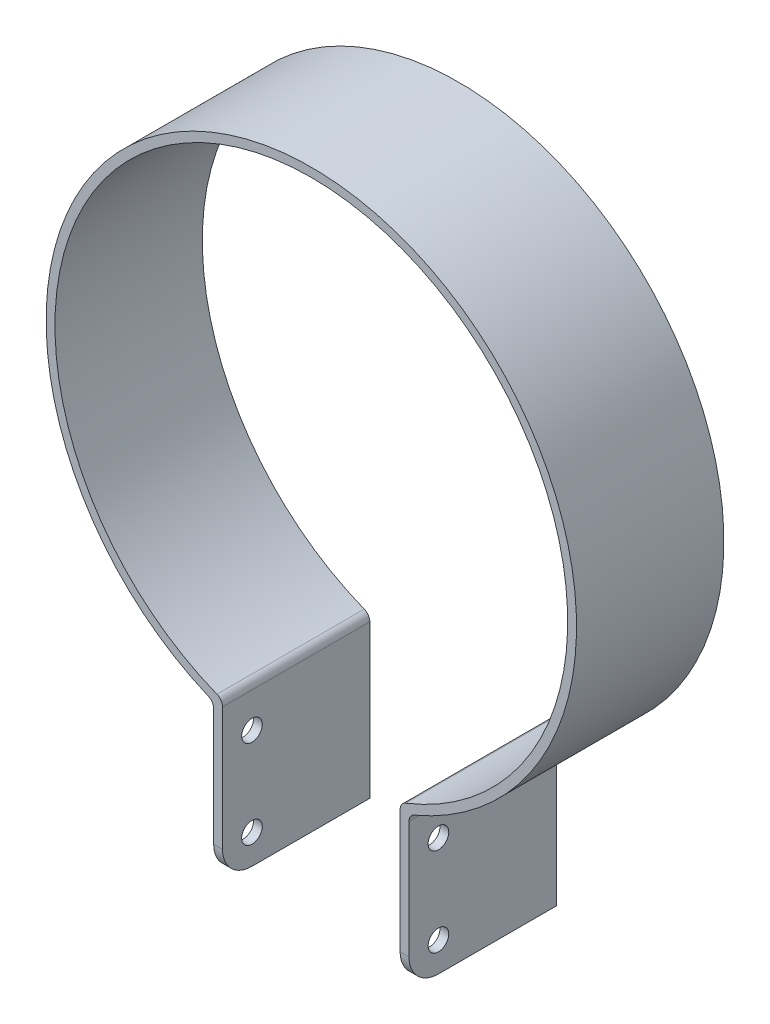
ISO-10303-21;
HEADER;
FILE_DESCRIPTION(('STEP AP214'),'2;1');
FILE_NAME('part.step','',(''),(''),'','','');
FILE_SCHEMA(('AUTOMOTIVE_DESIGN { 1 0 10303 214 1 1 1 1 }'));
ENDSEC;
DATA;
#1=APPLICATION_CONTEXT('core data for automotive mechanical design processes');
#2=APPLICATION_PROTOCOL_DEFINITION('international standard','automotive_design',2000,#1);
#3=PRODUCT_CONTEXT('',#1,'mechanical');
#4=PRODUCT('Part','Part','',(#3));
#5=PRODUCT_RELATED_PRODUCT_CATEGORY('part','',(#4));
#6=PRODUCT_DEFINITION_FORMATION('','',#4);
#7=PRODUCT_DEFINITION_CONTEXT('part definition',#1,'design');
#8=PRODUCT_DEFINITION('design','',#6,#7);
#9=PRODUCT_DEFINITION_SHAPE('','',#8);
#10=(LENGTH_UNIT() NAMED_UNIT(*) SI_UNIT(.MILLI.,.METRE.));
#11=(NAMED_UNIT(*) PLANE_ANGLE_UNIT() SI_UNIT($,.RADIAN.));
#12=(NAMED_UNIT(*) SI_UNIT($,.STERADIAN.) SOLID_ANGLE_UNIT());
#13=UNCERTAINTY_MEASURE_WITH_UNIT(LENGTH_MEASURE(1.E-05),#10,'distance_accuracy_value','');
#14=(GEOMETRIC_REPRESENTATION_CONTEXT(3) GLOBAL_UNCERTAINTY_ASSIGNED_CONTEXT((#13)) GLOBAL_UNIT_ASSIGNED_CONTEXT((#10,
#11,#12)) REPRESENTATION_CONTEXT('',''));
#15=CARTESIAN_POINT('',(0.,0.,0.));
#16=DIRECTION('',(0.,0.,1.));
#17=DIRECTION('',(1.,0.,0.));
#18=AXIS2_PLACEMENT_3D('',#15,#16,#17);
#19=CARTESIAN_POINT('',(-16.57,-67.7668095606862,25.));
#20=DIRECTION('',(0.,1.,0.));
#21=DIRECTION('',(0.,0.,1.));
#22=AXIS2_PLACEMENT_3D('',#19,#20,#21);
#23=PLANE('',#22);
#24=DIRECTION('',(0.,0.,-1.));
#25=VECTOR('',#24,1.);
#26=CARTESIAN_POINT('',(-15.07,-67.7668095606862,25.));
#27=LINE('',#26,#25);
#28=CARTESIAN_POINT('',(-15.07,-67.7668095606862,20.));
#29=VERTEX_POINT('',#28);
#30=CARTESIAN_POINT('',(-15.07,-67.7668095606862,0.));
#31=VERTEX_POINT('',#30);
#32=EDGE_CURVE('E150',#29,#31,#27,.T.);
#33=ORIENTED_EDGE('',*,*,#32,.F.);
#34=DIRECTION('',(1.,0.,0.));
#35=VECTOR('',#34,1.);
#36=CARTESIAN_POINT('',(-16.57,-67.7668095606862,20.));
#37=LINE('',#36,#35);
#38=CARTESIAN_POINT('',(-16.57,-67.7668095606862,20.));
#39=VERTEX_POINT('',#38);
#40=EDGE_CURVE('E40',#29,#39,#37,.F.);
#41=ORIENTED_EDGE('',*,*,#40,.T.);
#42=DIRECTION('',(0.,0.,-1.));
#43=VECTOR('',#42,1.);
#44=CARTESIAN_POINT('',(-16.57,-67.7668095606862,25.));
#45=LINE('',#44,#43);
#46=CARTESIAN_POINT('',(-16.57,-67.7668095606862,0.));
#47=VERTEX_POINT('',#46);
#48=EDGE_CURVE('E175',#39,#47,#45,.T.);
#49=ORIENTED_EDGE('',*,*,#48,.T.);
#50=DIRECTION('',(1.,0.,0.));
#51=VECTOR('',#50,1.);
#52=CARTESIAN_POINT('',(-16.57,-67.7668095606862,0.));
#53=LINE('',#52,#51);
#54=EDGE_CURVE('E176',#47,#31,#53,.T.);
#55=ORIENTED_EDGE('',*,*,#54,.T.);
#56=EDGE_LOOP('',(#33,#41,#49,#55));
#57=FACE_BOUND('',#56,.T.);
#58=ADVANCED_FACE('F31',(#57),#23,.F.);
#59=CARTESIAN_POINT('',(-15.07,-41.8382014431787,25.));
#60=DIRECTION('',(-1.,0.,0.));
#61=DIRECTION('',(0.,-1.,0.));
#62=AXIS2_PLACEMENT_3D('',#59,#60,#61);
#63=PLANE('',#62);
#64=CARTESIAN_POINT('',(-15.07,-62.7668095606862,20.));
#65=DIRECTION('',(-1.,0.,0.));
#66=DIRECTION('',(0.,-1.,0.));
#67=AXIS2_PLACEMENT_3D('',#64,#65,#66);
#68=CIRCLE('',#67,1.75);
#69=CARTESIAN_POINT('',(-15.07,-64.5168095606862,20.));
#70=VERTEX_POINT('',#69);
#71=EDGE_CURVE('E248',#70,#70,#68,.T.);
#72=ORIENTED_EDGE('',*,*,#71,.T.);
#73=EDGE_LOOP('',(#72));
#74=FACE_BOUND('',#73,.T.);
#75=CARTESIAN_POINT('',(-15.07,-47.7668095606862,20.));
#76=DIRECTION('',(-1.,0.,0.));
#77=DIRECTION('',(0.,-1.,0.));
#78=AXIS2_PLACEMENT_3D('',#75,#76,#77);
#79=CIRCLE('',#78,1.75);
#80=CARTESIAN_POINT('',(-15.07,-49.5168095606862,20.));
#81=VERTEX_POINT('',#80);
#82=EDGE_CURVE('E179',#81,#81,#79,.T.);
#83=ORIENTED_EDGE('',*,*,#82,.T.);
#84=EDGE_LOOP('',(#83));
#85=FACE_BOUND('',#84,.T.);
#86=DIRECTION('',(0.,1.,0.));
#87=VECTOR('',#86,1.);
#88=CARTESIAN_POINT('',(-15.07,-41.8382014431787,25.));
#89=LINE('',#88,#87);
#90=CARTESIAN_POINT('',(-15.07,-62.7668095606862,25.));
#91=VERTEX_POINT('',#90);
#92=CARTESIAN_POINT('',(-15.07,-41.8382014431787,25.));
#93=VERTEX_POINT('',#92);
#94=EDGE_CURVE('E131',#91,#93,#89,.T.);
#95=ORIENTED_EDGE('',*,*,#94,.F.);
#96=CARTESIAN_POINT('',(-15.07,-62.7668095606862,20.));
#97=DIRECTION('',(-1.,0.,0.));
#98=DIRECTION('',(0.,-1.,0.));
#99=AXIS2_PLACEMENT_3D('',#96,#97,#98);
#100=CIRCLE('',#99,5.);
#101=EDGE_CURVE('E55',#91,#29,#100,.F.);
#102=ORIENTED_EDGE('',*,*,#101,.T.);
#103=ORIENTED_EDGE('',*,*,#32,.T.);
#104=DIRECTION('',(0.,1.,0.));
#105=VECTOR('',#104,1.);
#106=CARTESIAN_POINT('',(-15.07,-41.8382014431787,0.));
#107=LINE('',#106,#105);
#108=CARTESIAN_POINT('',(-15.07,-41.8382014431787,0.));
#109=VERTEX_POINT('',#108);
#110=EDGE_CURVE('E147',#31,#109,#107,.T.);
#111=ORIENTED_EDGE('',*,*,#110,.T.);
#112=DIRECTION('',(0.,0.,-1.));
#113=VECTOR('',#112,1.);
#114=CARTESIAN_POINT('',(-15.07,-41.8382014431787,25.));
#115=LINE('',#114,#113);
#116=EDGE_CURVE('E144',#93,#109,#115,.T.);
#117=ORIENTED_EDGE('',*,*,#116,.F.);
#118=EDGE_LOOP('',(#95,#102,#103,#111,#117));
#119=FACE_BOUND('',#118,.T.);
#120=ADVANCED_FACE('F145',(#74,#85,#119),#63,.F.);
#121=CARTESIAN_POINT('',(-16.57,-41.8382014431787,25.));
#122=DIRECTION('',(0.,0.,-1.));
#123=DIRECTION('',(-1.,0.,0.));
#124=AXIS2_PLACEMENT_3D('',#121,#122,#123);
#125=CYLINDRICAL_SURFACE('',#124,1.5);
#126=CARTESIAN_POINT('',(-16.57,-41.8382014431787,0.));
#127=DIRECTION('',(0.,0.,1.));
#128=DIRECTION('',(1.,0.,0.));
#129=AXIS2_PLACEMENT_3D('',#126,#127,#128);
#130=CIRCLE('',#129,1.5);
#131=CARTESIAN_POINT('',(-16.0176666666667,-40.4435947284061,0.));
#132=VERTEX_POINT('',#131);
#133=EDGE_CURVE('E181',#109,#132,#130,.T.);
#134=ORIENTED_EDGE('',*,*,#133,.T.);
#135=DIRECTION('',(0.,0.,-1.));
#136=VECTOR('',#135,1.);
#137=CARTESIAN_POINT('',(-16.0176666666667,-40.4435947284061,25.));
#138=LINE('',#137,#136);
#139=CARTESIAN_POINT('',(-16.0176666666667,-40.4435947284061,25.));
#140=VERTEX_POINT('',#139);
#141=EDGE_CURVE('E151',#140,#132,#138,.T.);
#142=ORIENTED_EDGE('',*,*,#141,.F.);
#143=CARTESIAN_POINT('',(-16.57,-41.8382014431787,25.));
#144=DIRECTION('',(0.,0.,1.));
#145=DIRECTION('',(1.,0.,0.));
#146=AXIS2_PLACEMENT_3D('',#143,#144,#145);
#147=CIRCLE('',#146,1.5);
#148=EDGE_CURVE('E136',#93,#140,#147,.T.);
#149=ORIENTED_EDGE('',*,*,#148,.F.);
#150=ORIENTED_EDGE('',*,*,#116,.T.);
#151=EDGE_LOOP('',(#134,#142,#149,#150));
#152=FACE_BOUND('',#151,.T.);
#153=ADVANCED_FACE('F153',(#152),#125,.T.);
#154=CARTESIAN_POINT('',(0.,0.,25.));
#155=DIRECTION('',(0.,0.,-1.));
#156=DIRECTION('',(-1.,0.,0.));
#157=AXIS2_PLACEMENT_3D('',#154,#155,#156);
#158=CYLINDRICAL_SURFACE('',#157,43.5);
#159=CARTESIAN_POINT('',(0.,0.,0.));
#160=DIRECTION('',(0.,0.,-1.));
#161=DIRECTION('',(1.,0.,0.));
#162=AXIS2_PLACEMENT_3D('',#159,#160,#161);
#163=CIRCLE('',#162,43.5);
#164=CARTESIAN_POINT('',(16.0176666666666,-40.4435947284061,0.));
#165=VERTEX_POINT('',#164);
#166=EDGE_CURVE('E183',#132,#165,#163,.T.);
#167=ORIENTED_EDGE('',*,*,#166,.T.);
#168=DIRECTION('',(0.,0.,-1.));
#169=VECTOR('',#168,1.);
#170=CARTESIAN_POINT('',(16.0176666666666,-40.4435947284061,25.));
#171=LINE('',#170,#169);
#172=CARTESIAN_POINT('',(16.0176666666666,-40.4435947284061,25.));
#173=VERTEX_POINT('',#172);
#174=EDGE_CURVE('E223',#173,#165,#171,.T.);
#175=ORIENTED_EDGE('',*,*,#174,.F.);
#176=CARTESIAN_POINT('',(0.,0.,25.));
#177=DIRECTION('',(0.,0.,-1.));
#178=DIRECTION('',(1.,0.,0.));
#179=AXIS2_PLACEMENT_3D('',#176,#177,#178);
#180=CIRCLE('',#179,43.5);
#181=EDGE_CURVE('E156',#140,#173,#180,.T.);
#182=ORIENTED_EDGE('',*,*,#181,.F.);
#183=ORIENTED_EDGE('',*,*,#141,.T.);
#184=EDGE_LOOP('',(#167,#175,#182,#183));
#185=FACE_BOUND('',#184,.T.);
#186=ADVANCED_FACE('F336',(#185),#158,.F.);
#187=CARTESIAN_POINT('',(16.57,-41.8382014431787,25.));
#188=DIRECTION('',(0.,0.,-1.));
#189=DIRECTION('',(-1.,0.,0.));
#190=AXIS2_PLACEMENT_3D('',#187,#188,#189);
#191=CYLINDRICAL_SURFACE('',#190,1.5);
#192=CARTESIAN_POINT('',(16.57,-41.8382014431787,0.));
#193=DIRECTION('',(0.,0.,1.));
#194=DIRECTION('',(-1.,0.,0.));
#195=AXIS2_PLACEMENT_3D('',#192,#193,#194);
#196=CIRCLE('',#195,1.5);
#197=CARTESIAN_POINT('',(15.07,-41.8382014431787,0.));
#198=VERTEX_POINT('',#197);
#199=EDGE_CURVE('E185',#165,#198,#196,.T.);
#200=ORIENTED_EDGE('',*,*,#199,.T.);
#201=DIRECTION('',(0.,0.,-1.));
#202=VECTOR('',#201,1.);
#203=CARTESIAN_POINT('',(15.07,-41.8382014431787,25.));
#204=LINE('',#203,#202);
#205=CARTESIAN_POINT('',(15.07,-41.8382014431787,25.));
#206=VERTEX_POINT('',#205);
#207=EDGE_CURVE('E220',#206,#198,#204,.T.);
#208=ORIENTED_EDGE('',*,*,#207,.F.);
#209=CARTESIAN_POINT('',(16.57,-41.8382014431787,25.));
#210=DIRECTION('',(0.,0.,1.));
#211=DIRECTION('',(-1.,0.,0.));
#212=AXIS2_PLACEMENT_3D('',#209,#210,#211);
#213=CIRCLE('',#212,1.5);
#214=EDGE_CURVE('E158',#173,#206,#213,.T.);
#215=ORIENTED_EDGE('',*,*,#214,.F.);
#216=ORIENTED_EDGE('',*,*,#174,.T.);
#217=EDGE_LOOP('',(#200,#208,#215,#216));
#218=FACE_BOUND('',#217,.T.);
#219=ADVANCED_FACE('F302',(#218),#191,.T.);
#220=CARTESIAN_POINT('',(15.07,-41.8382014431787,25.));
#221=DIRECTION('',(1.,0.,0.));
#222=DIRECTION('',(0.,1.,0.));
#223=AXIS2_PLACEMENT_3D('',#220,#221,#222);
#224=PLANE('',#223);
#225=CARTESIAN_POINT('',(15.07,-62.7668095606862,20.));
#226=DIRECTION('',(1.,0.,0.));
#227=DIRECTION('',(0.,1.,0.));
#228=AXIS2_PLACEMENT_3D('',#225,#226,#227);
#229=CIRCLE('',#228,1.75);
#230=CARTESIAN_POINT('',(15.07,-61.0168095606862,20.));
#231=VERTEX_POINT('',#230);
#232=EDGE_CURVE('E253',#231,#231,#229,.T.);
#233=ORIENTED_EDGE('',*,*,#232,.T.);
#234=EDGE_LOOP('',(#233));
#235=FACE_BOUND('',#234,.T.);
#236=CARTESIAN_POINT('',(15.07,-47.7668095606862,20.));
#237=DIRECTION('',(1.,0.,0.));
#238=DIRECTION('',(0.,1.,0.));
#239=AXIS2_PLACEMENT_3D('',#236,#237,#238);
#240=CIRCLE('',#239,1.75);
#241=CARTESIAN_POINT('',(15.07,-46.0168095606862,20.));
#242=VERTEX_POINT('',#241);
#243=EDGE_CURVE('E241',#242,#242,#240,.T.);
#244=ORIENTED_EDGE('',*,*,#243,.T.);
#245=EDGE_LOOP('',(#244));
#246=FACE_BOUND('',#245,.T.);
#247=DIRECTION('',(0.,0.,-1.));
#248=VECTOR('',#247,1.);
#249=CARTESIAN_POINT('',(15.07,-67.7668095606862,25.));
#250=LINE('',#249,#248);
#251=CARTESIAN_POINT('',(15.07,-67.7668095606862,20.));
#252=VERTEX_POINT('',#251);
#253=CARTESIAN_POINT('',(15.07,-67.7668095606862,0.));
#254=VERTEX_POINT('',#253);
#255=EDGE_CURVE('E218',#252,#254,#250,.T.);
#256=ORIENTED_EDGE('',*,*,#255,.F.);
#257=CARTESIAN_POINT('',(15.07,-62.7668095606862,20.));
#258=DIRECTION('',(1.,0.,0.));
#259=DIRECTION('',(0.,1.,0.));
#260=AXIS2_PLACEMENT_3D('',#257,#258,#259);
#261=CIRCLE('',#260,5.);
#262=CARTESIAN_POINT('',(15.07,-62.7668095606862,25.));
#263=VERTEX_POINT('',#262);
#264=EDGE_CURVE('E236',#252,#263,#261,.F.);
#265=ORIENTED_EDGE('',*,*,#264,.T.);
#266=DIRECTION('',(0.,-1.,0.));
#267=VECTOR('',#266,1.);
#268=CARTESIAN_POINT('',(15.07,-41.8382014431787,25.));
#269=LINE('',#268,#267);
#270=EDGE_CURVE('E163',#206,#263,#269,.T.);
#271=ORIENTED_EDGE('',*,*,#270,.F.);
#272=ORIENTED_EDGE('',*,*,#207,.T.);
#273=DIRECTION('',(0.,-1.,0.));
#274=VECTOR('',#273,1.);
#275=CARTESIAN_POINT('',(15.07,-41.8382014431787,0.));
#276=LINE('',#275,#274);
#277=EDGE_CURVE('E187',#198,#254,#276,.T.);
#278=ORIENTED_EDGE('',*,*,#277,.T.);
#279=EDGE_LOOP('',(#256,#265,#271,#272,#278));
#280=FACE_BOUND('',#279,.T.);
#281=ADVANCED_FACE('F296',(#235,#246,#280),#224,.F.);
#282=CARTESIAN_POINT('',(15.07,-67.7668095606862,25.));
#283=DIRECTION('',(0.,1.,0.));
#284=DIRECTION('',(0.,0.,1.));
#285=AXIS2_PLACEMENT_3D('',#282,#283,#284);
#286=PLANE('',#285);
#287=DIRECTION('',(0.,0.,-1.));
#288=VECTOR('',#287,1.);
#289=CARTESIAN_POINT('',(16.57,-67.7668095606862,25.));
#290=LINE('',#289,#288);
#291=CARTESIAN_POINT('',(16.57,-67.7668095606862,20.));
#292=VERTEX_POINT('',#291);
#293=CARTESIAN_POINT('',(16.57,-67.7668095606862,0.));
#294=VERTEX_POINT('',#293);
#295=EDGE_CURVE('E216',#292,#294,#290,.T.);
#296=ORIENTED_EDGE('',*,*,#295,.F.);
#297=DIRECTION('',(1.,0.,0.));
#298=VECTOR('',#297,1.);
#299=CARTESIAN_POINT('',(15.07,-67.7668095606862,20.));
#300=LINE('',#299,#298);
#301=EDGE_CURVE('E234',#292,#252,#300,.F.);
#302=ORIENTED_EDGE('',*,*,#301,.T.);
#303=ORIENTED_EDGE('',*,*,#255,.T.);
#304=DIRECTION('',(1.,0.,0.));
#305=VECTOR('',#304,1.);
#306=CARTESIAN_POINT('',(15.07,-67.7668095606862,0.));
#307=LINE('',#306,#305);
#308=EDGE_CURVE('E190',#254,#294,#307,.T.);
#309=ORIENTED_EDGE('',*,*,#308,.T.);
#310=EDGE_LOOP('',(#296,#302,#303,#309));
#311=FACE_BOUND('',#310,.T.);
#312=ADVANCED_FACE('F312',(#311),#286,.F.);
#313=CARTESIAN_POINT('',(16.57,-42.8453626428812,25.));
#314=DIRECTION('',(-1.,0.,0.));
#315=DIRECTION('',(0.,-1.,0.));
#316=AXIS2_PLACEMENT_3D('',#313,#314,#315);
#317=PLANE('',#316);
#318=CARTESIAN_POINT('',(16.57,-62.7668095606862,20.));
#319=DIRECTION('',(1.,0.,0.));
#320=DIRECTION('',(0.,1.,0.));
#321=AXIS2_PLACEMENT_3D('',#318,#319,#320);
#322=CIRCLE('',#321,1.75);
#323=CARTESIAN_POINT('',(16.57,-61.0168095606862,20.));
#324=VERTEX_POINT('',#323);
#325=EDGE_CURVE('E449',#324,#324,#322,.T.);
#326=ORIENTED_EDGE('',*,*,#325,.F.);
#327=EDGE_LOOP('',(#326));
#328=FACE_BOUND('',#327,.T.);
#329=CARTESIAN_POINT('',(16.57,-47.7668095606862,20.));
#330=DIRECTION('',(1.,0.,0.));
#331=DIRECTION('',(0.,1.,0.));
#332=AXIS2_PLACEMENT_3D('',#329,#330,#331);
#333=CIRCLE('',#332,1.75);
#334=CARTESIAN_POINT('',(16.57,-46.0168095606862,20.));
#335=VERTEX_POINT('',#334);
#336=EDGE_CURVE('E242',#335,#335,#333,.T.);
#337=ORIENTED_EDGE('',*,*,#336,.F.);
#338=EDGE_LOOP('',(#337));
#339=FACE_BOUND('',#338,.T.);
#340=DIRECTION('',(0.,1.,0.));
#341=VECTOR('',#340,1.);
#342=CARTESIAN_POINT('',(16.57,-42.8453626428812,25.));
#343=LINE('',#342,#341);
#344=CARTESIAN_POINT('',(16.57,-62.7668095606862,25.));
#345=VERTEX_POINT('',#344);
#346=CARTESIAN_POINT('',(16.57,-42.8453626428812,25.));
#347=VERTEX_POINT('',#346);
#348=EDGE_CURVE('E165',#345,#347,#343,.T.);
#349=ORIENTED_EDGE('',*,*,#348,.F.);
#350=CARTESIAN_POINT('',(16.57,-62.7668095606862,20.));
#351=DIRECTION('',(-1.,0.,0.));
#352=DIRECTION('',(0.,-1.,0.));
#353=AXIS2_PLACEMENT_3D('',#350,#351,#352);
#354=CIRCLE('',#353,5.);
#355=EDGE_CURVE('E232',#345,#292,#354,.F.);
#356=ORIENTED_EDGE('',*,*,#355,.T.);
#357=ORIENTED_EDGE('',*,*,#295,.T.);
#358=DIRECTION('',(0.,1.,0.));
#359=VECTOR('',#358,1.);
#360=CARTESIAN_POINT('',(16.57,-42.8453626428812,0.));
#361=LINE('',#360,#359);
#362=CARTESIAN_POINT('',(16.57,-42.8453626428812,0.));
#363=VERTEX_POINT('',#362);
#364=EDGE_CURVE('E193',#294,#363,#361,.T.);
#365=ORIENTED_EDGE('',*,*,#364,.T.);
#366=DIRECTION('',(0.,0.,-1.));
#367=VECTOR('',#366,1.);
#368=CARTESIAN_POINT('',(16.57,-42.8453626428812,25.));
#369=LINE('',#368,#367);
#370=EDGE_CURVE('E213',#347,#363,#369,.T.);
#371=ORIENTED_EDGE('',*,*,#370,.F.);
#372=EDGE_LOOP('',(#349,#356,#357,#365,#371));
#373=FACE_BOUND('',#372,.T.);
#374=ADVANCED_FACE('F314',(#328,#339,#373),#317,.F.);
#375=CARTESIAN_POINT('',(18.07,-42.8453626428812,25.));
#376=DIRECTION('',(0.,0.,-1.));
#377=DIRECTION('',(-1.,0.,0.));
#378=AXIS2_PLACEMENT_3D('',#375,#376,#377);
#379=CYLINDRICAL_SURFACE('',#378,1.5);
#380=CARTESIAN_POINT('',(18.07,-42.8453626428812,0.));
#381=DIRECTION('',(0.,0.,-1.));
#382=DIRECTION('',(-1.,0.,0.));
#383=AXIS2_PLACEMENT_3D('',#380,#381,#382);
#384=CIRCLE('',#383,1.5);
#385=CARTESIAN_POINT('',(17.4870967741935,-41.4632541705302,0.));
#386=VERTEX_POINT('',#385);
#387=EDGE_CURVE('E195',#363,#386,#384,.T.);
#388=ORIENTED_EDGE('',*,*,#387,.T.);
#389=DIRECTION('',(0.,0.,-1.));
#390=VECTOR('',#389,1.);
#391=CARTESIAN_POINT('',(17.4870967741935,-41.4632541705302,25.));
#392=LINE('',#391,#390);
#393=CARTESIAN_POINT('',(17.4870967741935,-41.4632541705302,25.));
#394=VERTEX_POINT('',#393);
#395=EDGE_CURVE('E210',#394,#386,#392,.T.);
#396=ORIENTED_EDGE('',*,*,#395,.F.);
#397=CARTESIAN_POINT('',(18.07,-42.8453626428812,25.));
#398=DIRECTION('',(0.,0.,-1.));
#399=DIRECTION('',(-1.,0.,0.));
#400=AXIS2_PLACEMENT_3D('',#397,#398,#399);
#401=CIRCLE('',#400,1.5);
#402=EDGE_CURVE('E167',#347,#394,#401,.T.);
#403=ORIENTED_EDGE('',*,*,#402,.F.);
#404=ORIENTED_EDGE('',*,*,#370,.T.);
#405=EDGE_LOOP('',(#388,#396,#403,#404));
#406=FACE_BOUND('',#405,.T.);
#407=ADVANCED_FACE('F321',(#406),#379,.F.);
#408=CARTESIAN_POINT('',(0.,0.,25.));
#409=DIRECTION('',(0.,0.,-1.));
#410=DIRECTION('',(-1.,0.,0.));
#411=AXIS2_PLACEMENT_3D('',#408,#409,#410);
#412=CYLINDRICAL_SURFACE('',#411,45.);
#413=CARTESIAN_POINT('',(0.,0.,0.));
#414=DIRECTION('',(0.,0.,1.));
#415=DIRECTION('',(1.,0.,0.));
#416=AXIS2_PLACEMENT_3D('',#413,#414,#415);
#417=CIRCLE('',#416,45.);
#418=CARTESIAN_POINT('',(-17.4870967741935,-41.4632541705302,0.));
#419=VERTEX_POINT('',#418);
#420=EDGE_CURVE('E197',#386,#419,#417,.T.);
#421=ORIENTED_EDGE('',*,*,#420,.T.);
#422=DIRECTION('',(0.,0.,-1.));
#423=VECTOR('',#422,1.);
#424=CARTESIAN_POINT('',(-17.4870967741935,-41.4632541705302,25.));
#425=LINE('',#424,#423);
#426=CARTESIAN_POINT('',(-17.4870967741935,-41.4632541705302,25.));
#427=VERTEX_POINT('',#426);
#428=EDGE_CURVE('E207',#427,#419,#425,.T.);
#429=ORIENTED_EDGE('',*,*,#428,.F.);
#430=CARTESIAN_POINT('',(0.,0.,25.));
#431=DIRECTION('',(0.,0.,1.));
#432=DIRECTION('',(1.,0.,0.));
#433=AXIS2_PLACEMENT_3D('',#430,#431,#432);
#434=CIRCLE('',#433,45.);
#435=EDGE_CURVE('E169',#394,#427,#434,.T.);
#436=ORIENTED_EDGE('',*,*,#435,.F.);
#437=ORIENTED_EDGE('',*,*,#395,.T.);
#438=EDGE_LOOP('',(#421,#429,#436,#437));
#439=FACE_BOUND('',#438,.T.);
#440=ADVANCED_FACE('F324',(#439),#412,.T.);
#441=CARTESIAN_POINT('',(-18.07,-42.8453626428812,25.));
#442=DIRECTION('',(0.,0.,-1.));
#443=DIRECTION('',(-1.,0.,0.));
#444=AXIS2_PLACEMENT_3D('',#441,#442,#443);
#445=CYLINDRICAL_SURFACE('',#444,1.5);
#446=CARTESIAN_POINT('',(-18.07,-42.8453626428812,0.));
#447=DIRECTION('',(0.,0.,-1.));
#448=DIRECTION('',(1.,0.,0.));
#449=AXIS2_PLACEMENT_3D('',#446,#447,#448);
#450=CIRCLE('',#449,1.5);
#451=CARTESIAN_POINT('',(-16.57,-42.8453626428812,0.));
#452=VERTEX_POINT('',#451);
#453=EDGE_CURVE('E199',#419,#452,#450,.T.);
#454=ORIENTED_EDGE('',*,*,#453,.T.);
#455=DIRECTION('',(0.,0.,-1.));
#456=VECTOR('',#455,1.);
#457=CARTESIAN_POINT('',(-16.57,-42.8453626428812,25.));
#458=LINE('',#457,#456);
#459=CARTESIAN_POINT('',(-16.57,-42.8453626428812,25.));
#460=VERTEX_POINT('',#459);
#461=EDGE_CURVE('E204',#460,#452,#458,.T.);
#462=ORIENTED_EDGE('',*,*,#461,.F.);
#463=CARTESIAN_POINT('',(-18.07,-42.8453626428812,25.));
#464=DIRECTION('',(0.,0.,-1.));
#465=DIRECTION('',(1.,0.,0.));
#466=AXIS2_PLACEMENT_3D('',#463,#464,#465);
#467=CIRCLE('',#466,1.5);
#468=EDGE_CURVE('E171',#427,#460,#467,.T.);
#469=ORIENTED_EDGE('',*,*,#468,.F.);
#470=ORIENTED_EDGE('',*,*,#428,.T.);
#471=EDGE_LOOP('',(#454,#462,#469,#470));
#472=FACE_BOUND('',#471,.T.);
#473=ADVANCED_FACE('F329',(#472),#445,.F.);
#474=CARTESIAN_POINT('',(-16.57,-42.8453626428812,25.));
#475=DIRECTION('',(1.,0.,0.));
#476=DIRECTION('',(0.,1.,0.));
#477=AXIS2_PLACEMENT_3D('',#474,#475,#476);
#478=PLANE('',#477);
#479=CARTESIAN_POINT('',(-16.57,-62.7668095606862,20.));
#480=DIRECTION('',(1.,0.,0.));
#481=DIRECTION('',(0.,1.,0.));
#482=AXIS2_PLACEMENT_3D('',#479,#480,#481);
#483=CIRCLE('',#482,1.75);
#484=CARTESIAN_POINT('',(-16.57,-61.0168095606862,20.));
#485=VERTEX_POINT('',#484);
#486=EDGE_CURVE('E35',#485,#485,#483,.T.);
#487=ORIENTED_EDGE('',*,*,#486,.T.);
#488=EDGE_LOOP('',(#487));
#489=FACE_BOUND('',#488,.T.);
#490=CARTESIAN_POINT('',(-16.57,-47.7668095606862,20.));
#491=DIRECTION('',(1.,0.,0.));
#492=DIRECTION('',(0.,1.,0.));
#493=AXIS2_PLACEMENT_3D('',#490,#491,#492);
#494=CIRCLE('',#493,1.75);
#495=CARTESIAN_POINT('',(-16.57,-46.0168095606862,20.));
#496=VERTEX_POINT('',#495);
#497=EDGE_CURVE('E239',#496,#496,#494,.T.);
#498=ORIENTED_EDGE('',*,*,#497,.T.);
#499=EDGE_LOOP('',(#498));
#500=FACE_BOUND('',#499,.T.);
#501=ORIENTED_EDGE('',*,*,#48,.F.);
#502=CARTESIAN_POINT('',(-16.57,-62.7668095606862,20.));
#503=DIRECTION('',(1.,0.,0.));
#504=DIRECTION('',(0.,1.,0.));
#505=AXIS2_PLACEMENT_3D('',#502,#503,#504);
#506=CIRCLE('',#505,5.);
#507=CARTESIAN_POINT('',(-16.57,-62.7668095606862,25.));
#508=VERTEX_POINT('',#507);
#509=EDGE_CURVE('E11',#39,#508,#506,.F.);
#510=ORIENTED_EDGE('',*,*,#509,.T.);
#511=DIRECTION('',(0.,-1.,0.));
#512=VECTOR('',#511,1.);
#513=CARTESIAN_POINT('',(-16.57,-42.8453626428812,25.));
#514=LINE('',#513,#512);
#515=EDGE_CURVE('E173',#460,#508,#514,.T.);
#516=ORIENTED_EDGE('',*,*,#515,.F.);
#517=ORIENTED_EDGE('',*,*,#461,.T.);
#518=DIRECTION('',(0.,-1.,0.));
#519=VECTOR('',#518,1.);
#520=CARTESIAN_POINT('',(-16.57,-42.8453626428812,0.));
#521=LINE('',#520,#519);
#522=EDGE_CURVE('E141',#452,#47,#521,.T.);
#523=ORIENTED_EDGE('',*,*,#522,.T.);
#524=EDGE_LOOP('',(#501,#510,#516,#517,#523));
#525=FACE_BOUND('',#524,.T.);
#526=ADVANCED_FACE('F333',(#489,#500,#525),#478,.F.);
#527=CARTESIAN_POINT('',(-16.57,-41.8382014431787,25.));
#528=DIRECTION('',(0.,0.,1.));
#529=DIRECTION('',(1.,0.,0.));
#530=AXIS2_PLACEMENT_3D('',#527,#528,#529);
#531=PLANE('',#530);
#532=ORIENTED_EDGE('',*,*,#270,.T.);
#533=DIRECTION('',(1.,0.,0.));
#534=VECTOR('',#533,1.);
#535=CARTESIAN_POINT('',(16.57,-62.7668095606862,25.));
#536=LINE('',#535,#534);
#537=EDGE_CURVE('E229',#263,#345,#536,.T.);
#538=ORIENTED_EDGE('',*,*,#537,.T.);
#539=ORIENTED_EDGE('',*,*,#348,.T.);
#540=ORIENTED_EDGE('',*,*,#402,.T.);
#541=ORIENTED_EDGE('',*,*,#435,.T.);
#542=ORIENTED_EDGE('',*,*,#468,.T.);
#543=ORIENTED_EDGE('',*,*,#515,.T.);
#544=DIRECTION('',(1.,0.,0.));
#545=VECTOR('',#544,1.);
#546=CARTESIAN_POINT('',(-15.07,-62.7668095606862,25.));
#547=LINE('',#546,#545);
#548=EDGE_CURVE('E140',#508,#91,#547,.T.);
#549=ORIENTED_EDGE('',*,*,#548,.T.);
#550=ORIENTED_EDGE('',*,*,#94,.T.);
#551=ORIENTED_EDGE('',*,*,#148,.T.);
#552=ORIENTED_EDGE('',*,*,#181,.T.);
#553=ORIENTED_EDGE('',*,*,#214,.T.);
#554=EDGE_LOOP('',(#532,#538,#539,#540,#541,#542,#543,#549,#550,#551,#552,#553));
#555=FACE_BOUND('',#554,.T.);
#556=ADVANCED_FACE('F134',(#555),#531,.T.);
#557=CARTESIAN_POINT('',(-16.57,-41.8382014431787,0.));
#558=DIRECTION('',(0.,0.,1.));
#559=DIRECTION('',(1.,0.,0.));
#560=AXIS2_PLACEMENT_3D('',#557,#558,#559);
#561=PLANE('',#560);
#562=ORIENTED_EDGE('',*,*,#54,.F.);
#563=ORIENTED_EDGE('',*,*,#522,.F.);
#564=ORIENTED_EDGE('',*,*,#453,.F.);
#565=ORIENTED_EDGE('',*,*,#420,.F.);
#566=ORIENTED_EDGE('',*,*,#387,.F.);
#567=ORIENTED_EDGE('',*,*,#364,.F.);
#568=ORIENTED_EDGE('',*,*,#308,.F.);
#569=ORIENTED_EDGE('',*,*,#277,.F.);
#570=ORIENTED_EDGE('',*,*,#199,.F.);
#571=ORIENTED_EDGE('',*,*,#166,.F.);
#572=ORIENTED_EDGE('',*,*,#133,.F.);
#573=ORIENTED_EDGE('',*,*,#110,.F.);
#574=EDGE_LOOP('',(#562,#563,#564,#565,#566,#567,#568,#569,#570,#571,#572,#573));
#575=FACE_BOUND('',#574,.T.);
#576=ADVANCED_FACE('F283',(#575),#561,.F.);
#577=CARTESIAN_POINT('',(-16.57,-62.7668095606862,20.));
#578=DIRECTION('',(-1.,0.,0.));
#579=DIRECTION('',(0.,0.,1.));
#580=AXIS2_PLACEMENT_3D('',#577,#578,#579);
#581=CYLINDRICAL_SURFACE('',#580,5.);
#582=ORIENTED_EDGE('',*,*,#264,.F.);
#583=ORIENTED_EDGE('',*,*,#301,.F.);
#584=ORIENTED_EDGE('',*,*,#355,.F.);
#585=ORIENTED_EDGE('',*,*,#537,.F.);
#586=EDGE_LOOP('',(#582,#583,#584,#585));
#587=FACE_BOUND('',#586,.T.);
#588=ADVANCED_FACE('F270',(#587),#581,.T.);
#589=CARTESIAN_POINT('',(-16.57,-62.7668095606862,20.));
#590=DIRECTION('',(-1.,0.,0.));
#591=DIRECTION('',(0.,0.,1.));
#592=AXIS2_PLACEMENT_3D('',#589,#590,#591);
#593=CYLINDRICAL_SURFACE('',#592,5.);
#594=ORIENTED_EDGE('',*,*,#509,.F.);
#595=ORIENTED_EDGE('',*,*,#40,.F.);
#596=ORIENTED_EDGE('',*,*,#101,.F.);
#597=ORIENTED_EDGE('',*,*,#548,.F.);
#598=EDGE_LOOP('',(#594,#595,#596,#597));
#599=FACE_BOUND('',#598,.T.);
#600=ADVANCED_FACE('F33',(#599),#593,.T.);
#601=CARTESIAN_POINT('',(-45.,-47.7668095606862,20.));
#602=DIRECTION('',(1.,0.,0.));
#603=DIRECTION('',(0.,1.,0.));
#604=AXIS2_PLACEMENT_3D('',#601,#602,#603);
#605=CYLINDRICAL_SURFACE('',#604,1.75);
#606=ORIENTED_EDGE('',*,*,#497,.F.);
#607=EDGE_LOOP('',(#606));
#608=FACE_BOUND('',#607,.T.);
#609=ORIENTED_EDGE('',*,*,#82,.F.);
#610=EDGE_LOOP('',(#609));
#611=FACE_BOUND('',#610,.T.);
#612=ADVANCED_FACE('F260',(#608,#611),#605,.F.);
#613=ORIENTED_EDGE('',*,*,#336,.T.);
#614=EDGE_LOOP('',(#613));
#615=FACE_BOUND('',#614,.T.);
#616=ORIENTED_EDGE('',*,*,#243,.F.);
#617=EDGE_LOOP('',(#616));
#618=FACE_BOUND('',#617,.T.);
#619=ADVANCED_FACE('F262',(#615,#618),#605,.F.);
#620=CARTESIAN_POINT('',(-45.,-62.7668095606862,20.));
#621=DIRECTION('',(1.,0.,0.));
#622=DIRECTION('',(0.,1.,0.));
#623=AXIS2_PLACEMENT_3D('',#620,#621,#622);
#624=CYLINDRICAL_SURFACE('',#623,1.75);
#625=ORIENTED_EDGE('',*,*,#486,.F.);
#626=EDGE_LOOP('',(#625));
#627=FACE_BOUND('',#626,.T.);
#628=ORIENTED_EDGE('',*,*,#71,.F.);
#629=EDGE_LOOP('',(#628));
#630=FACE_BOUND('',#629,.T.);
#631=ADVANCED_FACE('F269',(#627,#630),#624,.F.);
#632=ORIENTED_EDGE('',*,*,#325,.T.);
#633=EDGE_LOOP('',(#632));
#634=FACE_BOUND('',#633,.T.);
#635=ORIENTED_EDGE('',*,*,#232,.F.);
#636=EDGE_LOOP('',(#635));
#637=FACE_BOUND('',#636,.T.);
#638=ADVANCED_FACE('F434',(#634,#637),#624,.F.);
#639=CLOSED_SHELL('',(#58,#120,#153,#186,#219,#281,#312,#374,#407,#440,#473,#526,#556,#576,#588,
#600,#612,#619,#631,#638));
#640=MANIFOLD_SOLID_BREP('B2',#639);
#641=ADVANCED_BREP_SHAPE_REPRESENTATION('',(#18,#640),#14);
#642=SHAPE_DEFINITION_REPRESENTATION(#9,#641);
ENDSEC;
END-ISO-10303-21;
